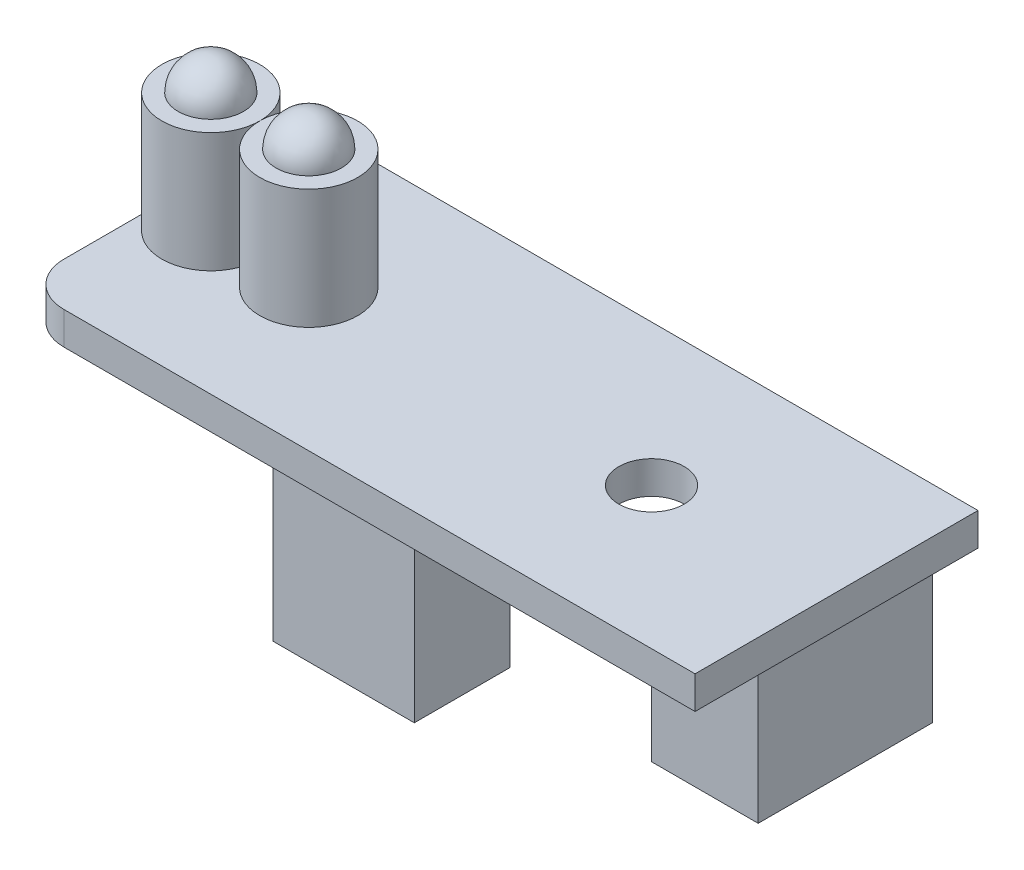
ISO-10303-21;
HEADER;
FILE_DESCRIPTION(('STEP AP214'),'2;1');
FILE_NAME('part.step','',(''),(''),'','','');
FILE_SCHEMA(('AUTOMOTIVE_DESIGN { 1 0 10303 214 1 1 1 1 }'));
ENDSEC;
DATA;
#1=APPLICATION_CONTEXT('core data for automotive mechanical design processes');
#2=APPLICATION_PROTOCOL_DEFINITION('international standard','automotive_design',2000,#1);
#3=PRODUCT_CONTEXT('',#1,'mechanical');
#4=PRODUCT('Part','Part','',(#3));
#5=PRODUCT_RELATED_PRODUCT_CATEGORY('part','',(#4));
#6=PRODUCT_DEFINITION_FORMATION('','',#4);
#7=PRODUCT_DEFINITION_CONTEXT('part definition',#1,'design');
#8=PRODUCT_DEFINITION('design','',#6,#7);
#9=PRODUCT_DEFINITION_SHAPE('','',#8);
#10=(LENGTH_UNIT() NAMED_UNIT(*) SI_UNIT(.MILLI.,.METRE.));
#11=(NAMED_UNIT(*) PLANE_ANGLE_UNIT() SI_UNIT($,.RADIAN.));
#12=(NAMED_UNIT(*) SI_UNIT($,.STERADIAN.) SOLID_ANGLE_UNIT());
#13=UNCERTAINTY_MEASURE_WITH_UNIT(LENGTH_MEASURE(1.E-05),#10,'distance_accuracy_value','');
#14=(GEOMETRIC_REPRESENTATION_CONTEXT(3) GLOBAL_UNCERTAINTY_ASSIGNED_CONTEXT((#13)) GLOBAL_UNIT_ASSIGNED_CONTEXT((#10,
#11,#12)) REPRESENTATION_CONTEXT('',''));
#15=CARTESIAN_POINT('',(0.,0.,0.));
#16=DIRECTION('',(0.,0.,1.));
#17=DIRECTION('',(1.,0.,0.));
#18=AXIS2_PLACEMENT_3D('',#15,#16,#17);
#19=CARTESIAN_POINT('',(-8.75,7.,0.));
#20=DIRECTION('',(0.,-1.,0.));
#21=DIRECTION('',(0.,0.,-1.));
#22=AXIS2_PLACEMENT_3D('',#19,#20,#21);
#23=CYLINDRICAL_SURFACE('',#22,2.25);
#24=CARTESIAN_POINT('',(-8.75,7.,0.));
#25=DIRECTION('',(0.,1.,0.));
#26=DIRECTION('',(0.,0.,1.));
#27=AXIS2_PLACEMENT_3D('',#24,#25,#26);
#28=CIRCLE('',#27,2.25);
#29=CARTESIAN_POINT('',(-8.75,7.,2.25));
#30=VERTEX_POINT('',#29);
#31=EDGE_CURVE('E57',#30,#30,#28,.T.);
#32=ORIENTED_EDGE('',*,*,#31,.F.);
#33=EDGE_LOOP('',(#32));
#34=FACE_BOUND('',#33,.T.);
#35=CARTESIAN_POINT('',(-8.75,1.5,0.));
#36=DIRECTION('',(0.,1.,0.));
#37=DIRECTION('',(0.,0.,1.));
#38=AXIS2_PLACEMENT_3D('',#35,#36,#37);
#39=CIRCLE('',#38,2.25);
#40=CARTESIAN_POINT('',(-8.75,1.5,2.25));
#41=VERTEX_POINT('',#40);
#42=EDGE_CURVE('E61',#41,#41,#39,.T.);
#43=ORIENTED_EDGE('',*,*,#42,.T.);
#44=EDGE_LOOP('',(#43));
#45=FACE_BOUND('',#44,.T.);
#46=ADVANCED_FACE('F51',(#34,#45),#23,.T.);
#47=CARTESIAN_POINT('',(0.,7.,0.));
#48=DIRECTION('',(0.,1.,0.));
#49=DIRECTION('',(0.,0.,1.));
#50=AXIS2_PLACEMENT_3D('',#47,#48,#49);
#51=PLANE('',#50);
#52=CARTESIAN_POINT('',(-8.75,7.,0.));
#53=DIRECTION('',(0.,1.,0.));
#54=DIRECTION('',(0.,0.,1.));
#55=AXIS2_PLACEMENT_3D('',#52,#53,#54);
#56=CIRCLE('',#55,1.5);
#57=CARTESIAN_POINT('',(-8.75,7.,1.5));
#58=VERTEX_POINT('',#57);
#59=EDGE_CURVE('E12',#58,#58,#56,.T.);
#60=ORIENTED_EDGE('',*,*,#59,.F.);
#61=EDGE_LOOP('',(#60));
#62=FACE_BOUND('',#61,.T.);
#63=ORIENTED_EDGE('',*,*,#31,.T.);
#64=EDGE_LOOP('',(#63));
#65=FACE_BOUND('',#64,.T.);
#66=ADVANCED_FACE('F72',(#62,#65),#51,.T.);
#67=CARTESIAN_POINT('',(0.,1.5,0.));
#68=DIRECTION('',(0.,1.,0.));
#69=DIRECTION('',(0.,0.,1.));
#70=AXIS2_PLACEMENT_3D('',#67,#68,#69);
#71=PLANE('',#70);
#72=ORIENTED_EDGE('',*,*,#42,.F.);
#73=EDGE_LOOP('',(#72));
#74=FACE_BOUND('',#73,.T.);
#75=ADVANCED_FACE('F69',(#74),#71,.F.);
#76=CARTESIAN_POINT('',(-8.75,7.,0.));
#77=DIRECTION('',(0.,0.,-1.));
#78=DIRECTION('',(1.,0.,0.));
#79=AXIS2_PLACEMENT_3D('',#76,#77,#78);
#80=SPHERICAL_SURFACE('',#79,1.5);
#81=CARTESIAN_POINT('',(-8.75,7.,0.));
#82=DIRECTION('',(0.,1.,0.));
#83=DIRECTION('',(0.,0.,1.));
#84=AXIS2_PLACEMENT_3D('',#81,#82,#83);
#85=SPHERICAL_SURFACE('',#84,1.5);
#86=ORIENTED_EDGE('',*,*,#59,.T.);
#87=EDGE_LOOP('',(#86));
#88=FACE_BOUND('',#87,.T.);
#89=ADVANCED_FACE('F71',(#88),#85,.T.);
#90=CLOSED_SHELL('',(#46,#66,#75,#89));
#91=MANIFOLD_SOLID_BREP('B2',#90);
#92=CARTESIAN_POINT('',(-13.25,7.,0.));
#93=DIRECTION('',(0.,-1.,0.));
#94=DIRECTION('',(0.,0.,-1.));
#95=AXIS2_PLACEMENT_3D('',#92,#93,#94);
#96=CYLINDRICAL_SURFACE('',#95,2.25);
#97=CARTESIAN_POINT('',(-13.25,7.,0.));
#98=DIRECTION('',(0.,1.,0.));
#99=DIRECTION('',(0.,0.,1.));
#100=AXIS2_PLACEMENT_3D('',#97,#98,#99);
#101=CIRCLE('',#100,2.25);
#102=CARTESIAN_POINT('',(-13.25,7.,2.25));
#103=VERTEX_POINT('',#102);
#104=EDGE_CURVE('E131',#103,#103,#101,.T.);
#105=ORIENTED_EDGE('',*,*,#104,.F.);
#106=EDGE_LOOP('',(#105));
#107=FACE_BOUND('',#106,.T.);
#108=CARTESIAN_POINT('',(-13.25,1.5,0.));
#109=DIRECTION('',(0.,1.,0.));
#110=DIRECTION('',(0.,0.,1.));
#111=AXIS2_PLACEMENT_3D('',#108,#109,#110);
#112=CIRCLE('',#111,2.25);
#113=CARTESIAN_POINT('',(-13.25,1.5,2.25));
#114=VERTEX_POINT('',#113);
#115=EDGE_CURVE('E135',#114,#114,#112,.T.);
#116=ORIENTED_EDGE('',*,*,#115,.T.);
#117=EDGE_LOOP('',(#116));
#118=FACE_BOUND('',#117,.T.);
#119=ADVANCED_FACE('F125',(#107,#118),#96,.T.);
#120=CARTESIAN_POINT('',(0.,7.,0.));
#121=DIRECTION('',(0.,1.,0.));
#122=DIRECTION('',(0.,0.,1.));
#123=AXIS2_PLACEMENT_3D('',#120,#121,#122);
#124=PLANE('',#123);
#125=CARTESIAN_POINT('',(-13.25,7.,0.));
#126=DIRECTION('',(0.,1.,0.));
#127=DIRECTION('',(0.,0.,1.));
#128=AXIS2_PLACEMENT_3D('',#125,#126,#127);
#129=CIRCLE('',#128,1.5);
#130=CARTESIAN_POINT('',(-13.25,7.,1.5));
#131=VERTEX_POINT('',#130);
#132=EDGE_CURVE('E50',#131,#131,#129,.T.);
#133=ORIENTED_EDGE('',*,*,#132,.F.);
#134=EDGE_LOOP('',(#133));
#135=FACE_BOUND('',#134,.T.);
#136=ORIENTED_EDGE('',*,*,#104,.T.);
#137=EDGE_LOOP('',(#136));
#138=FACE_BOUND('',#137,.T.);
#139=ADVANCED_FACE('F146',(#135,#138),#124,.T.);
#140=CARTESIAN_POINT('',(0.,1.5,0.));
#141=DIRECTION('',(0.,1.,0.));
#142=DIRECTION('',(0.,0.,1.));
#143=AXIS2_PLACEMENT_3D('',#140,#141,#142);
#144=PLANE('',#143);
#145=ORIENTED_EDGE('',*,*,#115,.F.);
#146=EDGE_LOOP('',(#145));
#147=FACE_BOUND('',#146,.T.);
#148=ADVANCED_FACE('F143',(#147),#144,.F.);
#149=CARTESIAN_POINT('',(-13.25,7.,0.));
#150=DIRECTION('',(0.,0.,-1.));
#151=DIRECTION('',(1.,0.,0.));
#152=AXIS2_PLACEMENT_3D('',#149,#150,#151);
#153=SPHERICAL_SURFACE('',#152,1.5);
#154=CARTESIAN_POINT('',(-13.25,7.,0.));
#155=DIRECTION('',(0.,1.,0.));
#156=DIRECTION('',(0.,0.,1.));
#157=AXIS2_PLACEMENT_3D('',#154,#155,#156);
#158=SPHERICAL_SURFACE('',#157,1.5);
#159=ORIENTED_EDGE('',*,*,#132,.T.);
#160=EDGE_LOOP('',(#159));
#161=FACE_BOUND('',#160,.T.);
#162=ADVANCED_FACE('F145',(#161),#158,.T.);
#163=CLOSED_SHELL('',(#119,#139,#148,#162));
#164=MANIFOLD_SOLID_BREP('B7',#163);
#165=CARTESIAN_POINT('',(2.5,-7.,2.));
#166=DIRECTION('',(-1.,0.,0.));
#167=DIRECTION('',(0.,0.,1.));
#168=AXIS2_PLACEMENT_3D('',#165,#166,#167);
#169=PLANE('',#168);
#170=DIRECTION('',(0.,1.,0.));
#171=VECTOR('',#170,1.);
#172=CARTESIAN_POINT('',(2.5,-7.,6.4));
#173=LINE('',#172,#171);
#174=CARTESIAN_POINT('',(2.5,-7.,6.4));
#175=VERTEX_POINT('',#174);
#176=CARTESIAN_POINT('',(2.5,0.,6.4));
#177=VERTEX_POINT('',#176);
#178=EDGE_CURVE('E513',#175,#177,#173,.T.);
#179=ORIENTED_EDGE('',*,*,#178,.F.);
#180=DIRECTION('',(0.,0.,1.));
#181=VECTOR('',#180,1.);
#182=CARTESIAN_POINT('',(2.5,-7.,2.));
#183=LINE('',#182,#181);
#184=CARTESIAN_POINT('',(2.5,-7.,2.));
#185=VERTEX_POINT('',#184);
#186=EDGE_CURVE('E405',#185,#175,#183,.T.);
#187=ORIENTED_EDGE('',*,*,#186,.F.);
#188=DIRECTION('',(0.,1.,0.));
#189=VECTOR('',#188,1.);
#190=CARTESIAN_POINT('',(2.5,-7.,2.));
#191=LINE('',#190,#189);
#192=CARTESIAN_POINT('',(2.5,0.,2.));
#193=VERTEX_POINT('',#192);
#194=EDGE_CURVE('E413',#185,#193,#191,.T.);
#195=ORIENTED_EDGE('',*,*,#194,.T.);
#196=DIRECTION('',(0.,0.,1.));
#197=VECTOR('',#196,1.);
#198=CARTESIAN_POINT('',(2.5,0.,2.));
#199=LINE('',#198,#197);
#200=EDGE_CURVE('E404',#193,#177,#199,.T.);
#201=ORIENTED_EDGE('',*,*,#200,.T.);
#202=EDGE_LOOP('',(#179,#187,#195,#201));
#203=FACE_BOUND('',#202,.T.);
#204=ADVANCED_FACE('F186',(#203),#169,.F.);
#205=CARTESIAN_POINT('',(-4.,-7.,2.));
#206=DIRECTION('',(1.,0.,0.));
#207=DIRECTION('',(0.,0.,-1.));
#208=AXIS2_PLACEMENT_3D('',#205,#206,#207);
#209=PLANE('',#208);
#210=DIRECTION('',(0.,-1.,0.));
#211=VECTOR('',#210,1.);
#212=CARTESIAN_POINT('',(-4.,0.,6.4));
#213=LINE('',#212,#211);
#214=CARTESIAN_POINT('',(-4.,0.,6.4));
#215=VERTEX_POINT('',#214);
#216=CARTESIAN_POINT('',(-4.,-7.,6.4));
#217=VERTEX_POINT('',#216);
#218=EDGE_CURVE('E212',#215,#217,#213,.T.);
#219=ORIENTED_EDGE('',*,*,#218,.F.);
#220=DIRECTION('',(0.,0.,-1.));
#221=VECTOR('',#220,1.);
#222=CARTESIAN_POINT('',(-4.,0.,2.));
#223=LINE('',#222,#221);
#224=CARTESIAN_POINT('',(-4.,0.,2.));
#225=VERTEX_POINT('',#224);
#226=EDGE_CURVE('E190',#215,#225,#223,.T.);
#227=ORIENTED_EDGE('',*,*,#226,.T.);
#228=DIRECTION('',(0.,1.,0.));
#229=VECTOR('',#228,1.);
#230=CARTESIAN_POINT('',(-4.,-7.,2.));
#231=LINE('',#230,#229);
#232=CARTESIAN_POINT('',(-4.,-7.,2.));
#233=VERTEX_POINT('',#232);
#234=EDGE_CURVE('E493',#233,#225,#231,.T.);
#235=ORIENTED_EDGE('',*,*,#234,.F.);
#236=DIRECTION('',(0.,0.,-1.));
#237=VECTOR('',#236,1.);
#238=CARTESIAN_POINT('',(-4.,-7.,2.));
#239=LINE('',#238,#237);
#240=EDGE_CURVE('E408',#217,#233,#239,.T.);
#241=ORIENTED_EDGE('',*,*,#240,.F.);
#242=EDGE_LOOP('',(#219,#227,#235,#241));
#243=FACE_BOUND('',#242,.T.);
#244=ADVANCED_FACE('F509',(#243),#209,.F.);
#245=CARTESIAN_POINT('',(0.,-7.,0.));
#246=DIRECTION('',(0.,1.,0.));
#247=DIRECTION('',(0.,0.,1.));
#248=AXIS2_PLACEMENT_3D('',#245,#246,#247);
#249=PLANE('',#248);
#250=DIRECTION('',(1.,0.,0.));
#251=VECTOR('',#250,1.);
#252=CARTESIAN_POINT('',(-4.,-7.,6.4));
#253=LINE('',#252,#251);
#254=EDGE_CURVE('E516',#217,#175,#253,.T.);
#255=ORIENTED_EDGE('',*,*,#254,.F.);
#256=ORIENTED_EDGE('',*,*,#240,.T.);
#257=DIRECTION('',(1.,0.,0.));
#258=VECTOR('',#257,1.);
#259=CARTESIAN_POINT('',(-4.,-7.,2.));
#260=LINE('',#259,#258);
#261=EDGE_CURVE('E411',#233,#185,#260,.T.);
#262=ORIENTED_EDGE('',*,*,#261,.T.);
#263=ORIENTED_EDGE('',*,*,#186,.T.);
#264=EDGE_LOOP('',(#255,#256,#262,#263));
#265=FACE_BOUND('',#264,.T.);
#266=ADVANCED_FACE('F599',(#265),#249,.F.);
#267=CARTESIAN_POINT('',(0.,0.,0.));
#268=DIRECTION('',(0.,1.,0.));
#269=DIRECTION('',(0.,0.,1.));
#270=AXIS2_PLACEMENT_3D('',#267,#268,#269);
#271=PLANE('',#270);
#272=DIRECTION('',(-1.,0.,0.));
#273=VECTOR('',#272,1.);
#274=CARTESIAN_POINT('',(10.5,0.,3.5));
#275=LINE('',#274,#273);
#276=CARTESIAN_POINT('',(15.4,0.,3.5));
#277=VERTEX_POINT('',#276);
#278=CARTESIAN_POINT('',(10.5,0.,3.5));
#279=VERTEX_POINT('',#278);
#280=EDGE_CURVE('E344',#277,#279,#275,.T.);
#281=ORIENTED_EDGE('',*,*,#280,.F.);
#282=DIRECTION('',(0.,0.,1.));
#283=VECTOR('',#282,1.);
#284=CARTESIAN_POINT('',(15.4,0.,3.5));
#285=LINE('',#284,#283);
#286=CARTESIAN_POINT('',(15.4,0.,-4.5));
#287=VERTEX_POINT('',#286);
#288=EDGE_CURVE('E337',#287,#277,#285,.T.);
#289=ORIENTED_EDGE('',*,*,#288,.F.);
#290=DIRECTION('',(1.,0.,0.));
#291=VECTOR('',#290,1.);
#292=CARTESIAN_POINT('',(10.5,0.,-4.5));
#293=LINE('',#292,#291);
#294=CARTESIAN_POINT('',(10.5,0.,-4.5));
#295=VERTEX_POINT('',#294);
#296=EDGE_CURVE('E343',#295,#287,#293,.T.);
#297=ORIENTED_EDGE('',*,*,#296,.F.);
#298=DIRECTION('',(0.,0.,-1.));
#299=VECTOR('',#298,1.);
#300=CARTESIAN_POINT('',(10.5,0.,3.5));
#301=LINE('',#300,#299);
#302=EDGE_CURVE('E359',#279,#295,#301,.T.);
#303=ORIENTED_EDGE('',*,*,#302,.F.);
#304=EDGE_LOOP('',(#281,#289,#297,#303));
#305=FACE_BOUND('',#304,.T.);
#306=DIRECTION('',(0.,0.,-1.));
#307=VECTOR('',#306,1.);
#308=CARTESIAN_POINT('',(15.5,0.,-6.5));
#309=LINE('',#308,#307);
#310=CARTESIAN_POINT('',(15.5,0.,6.5));
#311=VERTEX_POINT('',#310);
#312=CARTESIAN_POINT('',(15.5,0.,-6.5));
#313=VERTEX_POINT('',#312);
#314=EDGE_CURVE('E476',#311,#313,#309,.T.);
#315=ORIENTED_EDGE('',*,*,#314,.F.);
#316=DIRECTION('',(1.,0.,0.));
#317=VECTOR('',#316,1.);
#318=CARTESIAN_POINT('',(-15.5,0.,6.5));
#319=LINE('',#318,#317);
#320=CARTESIAN_POINT('',(-13.5,0.,6.5));
#321=VERTEX_POINT('',#320);
#322=EDGE_CURVE('E420',#321,#311,#319,.T.);
#323=ORIENTED_EDGE('',*,*,#322,.F.);
#324=CARTESIAN_POINT('',(-13.5,0.,4.5));
#325=DIRECTION('',(0.,1.,0.));
#326=DIRECTION('',(0.,0.,1.));
#327=AXIS2_PLACEMENT_3D('',#324,#325,#326);
#328=CIRCLE('',#327,2.);
#329=CARTESIAN_POINT('',(-15.5,0.,4.5));
#330=VERTEX_POINT('',#329);
#331=EDGE_CURVE('E441',#321,#330,#328,.F.);
#332=ORIENTED_EDGE('',*,*,#331,.T.);
#333=DIRECTION('',(0.,0.,1.));
#334=VECTOR('',#333,1.);
#335=CARTESIAN_POINT('',(-15.5,0.,-6.5));
#336=LINE('',#335,#334);
#337=CARTESIAN_POINT('',(-15.5,0.,-4.5));
#338=VERTEX_POINT('',#337);
#339=EDGE_CURVE('E423',#338,#330,#336,.T.);
#340=ORIENTED_EDGE('',*,*,#339,.F.);
#341=CARTESIAN_POINT('',(-13.5,0.,-4.5));
#342=DIRECTION('',(0.,1.,0.));
#343=DIRECTION('',(0.,0.,1.));
#344=AXIS2_PLACEMENT_3D('',#341,#342,#343);
#345=CIRCLE('',#344,2.);
#346=CARTESIAN_POINT('',(-13.5,0.,-6.5));
#347=VERTEX_POINT('',#346);
#348=EDGE_CURVE('E439',#338,#347,#345,.F.);
#349=ORIENTED_EDGE('',*,*,#348,.T.);
#350=DIRECTION('',(-1.,0.,0.));
#351=VECTOR('',#350,1.);
#352=CARTESIAN_POINT('',(-15.5,0.,-6.5));
#353=LINE('',#352,#351);
#354=EDGE_CURVE('E474',#313,#347,#353,.T.);
#355=ORIENTED_EDGE('',*,*,#354,.F.);
#356=EDGE_LOOP('',(#315,#323,#332,#340,#349,#355));
#357=FACE_BOUND('',#356,.T.);
#358=DIRECTION('',(0.,0.,1.));
#359=VECTOR('',#358,1.);
#360=CARTESIAN_POINT('',(1.,0.,-0.105895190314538));
#361=LINE('',#360,#359);
#362=CARTESIAN_POINT('',(1.00000000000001,0.,-5.10589519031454));
#363=VERTEX_POINT('',#362);
#364=CARTESIAN_POINT('',(1.,0.,-0.105895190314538));
#365=VERTEX_POINT('',#364);
#366=EDGE_CURVE('E371',#363,#365,#361,.T.);
#367=ORIENTED_EDGE('',*,*,#366,.F.);
#368=DIRECTION('',(1.,0.,0.));
#369=VECTOR('',#368,1.);
#370=CARTESIAN_POINT('',(-3.,0.,-5.10589519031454));
#371=LINE('',#370,#369);
#372=CARTESIAN_POINT('',(-3.,0.,-5.10589519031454));
#373=VERTEX_POINT('',#372);
#374=EDGE_CURVE('E376',#373,#363,#371,.T.);
#375=ORIENTED_EDGE('',*,*,#374,.F.);
#376=DIRECTION('',(0.,0.,-1.));
#377=VECTOR('',#376,1.);
#378=CARTESIAN_POINT('',(-3.,0.,-0.105895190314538));
#379=LINE('',#378,#377);
#380=CARTESIAN_POINT('',(-3.,0.,-0.105895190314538));
#381=VERTEX_POINT('',#380);
#382=EDGE_CURVE('E388',#381,#373,#379,.T.);
#383=ORIENTED_EDGE('',*,*,#382,.F.);
#384=DIRECTION('',(-1.,0.,0.));
#385=VECTOR('',#384,1.);
#386=CARTESIAN_POINT('',(-3.,0.,-0.105895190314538));
#387=LINE('',#386,#385);
#388=EDGE_CURVE('E385',#365,#381,#387,.T.);
#389=ORIENTED_EDGE('',*,*,#388,.F.);
#390=EDGE_LOOP('',(#367,#375,#383,#389));
#391=FACE_BOUND('',#390,.T.);
#392=CARTESIAN_POINT('',(7.,0.,0.));
#393=DIRECTION('',(0.,-1.,0.));
#394=DIRECTION('',(0.,0.,-1.));
#395=AXIS2_PLACEMENT_3D('',#392,#393,#394);
#396=CIRCLE('',#395,1.5);
#397=CARTESIAN_POINT('',(7.,0.,-1.5));
#398=VERTEX_POINT('',#397);
#399=EDGE_CURVE('E490',#398,#398,#396,.T.);
#400=ORIENTED_EDGE('',*,*,#399,.F.);
#401=EDGE_LOOP('',(#400));
#402=FACE_BOUND('',#401,.T.);
#403=DIRECTION('',(-1.,0.,0.));
#404=VECTOR('',#403,1.);
#405=CARTESIAN_POINT('',(2.5,0.,6.4));
#406=LINE('',#405,#404);
#407=EDGE_CURVE('E511',#177,#215,#406,.T.);
#408=ORIENTED_EDGE('',*,*,#407,.F.);
#409=ORIENTED_EDGE('',*,*,#200,.F.);
#410=DIRECTION('',(1.,0.,0.));
#411=VECTOR('',#410,1.);
#412=CARTESIAN_POINT('',(-4.,0.,2.));
#413=LINE('',#412,#411);
#414=EDGE_CURVE('E409',#225,#193,#413,.T.);
#415=ORIENTED_EDGE('',*,*,#414,.F.);
#416=ORIENTED_EDGE('',*,*,#226,.F.);
#417=EDGE_LOOP('',(#408,#409,#415,#416));
#418=FACE_BOUND('',#417,.T.);
#419=ADVANCED_FACE('F339',(#305,#357,#391,#402,#418),#271,.F.);
#420=CARTESIAN_POINT('',(15.5,1.5,-6.5));
#421=DIRECTION('',(-1.,0.,0.));
#422=DIRECTION('',(0.,0.,1.));
#423=AXIS2_PLACEMENT_3D('',#420,#421,#422);
#424=PLANE('',#423);
#425=ORIENTED_EDGE('',*,*,#314,.T.);
#426=DIRECTION('',(0.,-1.,0.));
#427=VECTOR('',#426,1.);
#428=CARTESIAN_POINT('',(15.5,1.5,-6.5));
#429=LINE('',#428,#427);
#430=CARTESIAN_POINT('',(15.5,1.5,-6.5));
#431=VERTEX_POINT('',#430);
#432=EDGE_CURVE('E432',#431,#313,#429,.T.);
#433=ORIENTED_EDGE('',*,*,#432,.F.);
#434=DIRECTION('',(0.,0.,-1.));
#435=VECTOR('',#434,1.);
#436=CARTESIAN_POINT('',(15.5,1.5,-6.5));
#437=LINE('',#436,#435);
#438=CARTESIAN_POINT('',(15.5,1.5,6.5));
#439=VERTEX_POINT('',#438);
#440=EDGE_CURVE('E422',#439,#431,#437,.T.);
#441=ORIENTED_EDGE('',*,*,#440,.F.);
#442=DIRECTION('',(0.,-1.,0.));
#443=VECTOR('',#442,1.);
#444=CARTESIAN_POINT('',(15.5,1.5,6.5));
#445=LINE('',#444,#443);
#446=EDGE_CURVE('E429',#439,#311,#445,.T.);
#447=ORIENTED_EDGE('',*,*,#446,.T.);
#448=EDGE_LOOP('',(#425,#433,#441,#447));
#449=FACE_BOUND('',#448,.T.);
#450=ADVANCED_FACE('F612',(#449),#424,.F.);
#451=CARTESIAN_POINT('',(-15.5,1.5,-6.5));
#452=DIRECTION('',(0.,0.,1.));
#453=DIRECTION('',(1.,0.,0.));
#454=AXIS2_PLACEMENT_3D('',#451,#452,#453);
#455=PLANE('',#454);
#456=ORIENTED_EDGE('',*,*,#354,.T.);
#457=DIRECTION('',(0.,-1.,0.));
#458=VECTOR('',#457,1.);
#459=CARTESIAN_POINT('',(-13.5,1.5,-6.5));
#460=LINE('',#459,#458);
#461=CARTESIAN_POINT('',(-13.5,1.5,-6.5));
#462=VERTEX_POINT('',#461);
#463=EDGE_CURVE('E123',#347,#462,#460,.F.);
#464=ORIENTED_EDGE('',*,*,#463,.T.);
#465=DIRECTION('',(-1.,0.,0.));
#466=VECTOR('',#465,1.);
#467=CARTESIAN_POINT('',(-15.5,1.5,-6.5));
#468=LINE('',#467,#466);
#469=EDGE_CURVE('E484',#431,#462,#468,.T.);
#470=ORIENTED_EDGE('',*,*,#469,.F.);
#471=ORIENTED_EDGE('',*,*,#432,.T.);
#472=EDGE_LOOP('',(#456,#464,#470,#471));
#473=FACE_BOUND('',#472,.T.);
#474=ADVANCED_FACE('F617',(#473),#455,.F.);
#475=CARTESIAN_POINT('',(-15.5,1.5,-6.5));
#476=DIRECTION('',(1.,0.,0.));
#477=DIRECTION('',(0.,0.,-1.));
#478=AXIS2_PLACEMENT_3D('',#475,#476,#477);
#479=PLANE('',#478);
#480=ORIENTED_EDGE('',*,*,#339,.T.);
#481=DIRECTION('',(0.,-1.,0.));
#482=VECTOR('',#481,1.);
#483=CARTESIAN_POINT('',(-15.5,1.5,4.5));
#484=LINE('',#483,#482);
#485=CARTESIAN_POINT('',(-15.5,1.5,4.5));
#486=VERTEX_POINT('',#485);
#487=EDGE_CURVE('E446',#330,#486,#484,.F.);
#488=ORIENTED_EDGE('',*,*,#487,.T.);
#489=DIRECTION('',(0.,0.,1.));
#490=VECTOR('',#489,1.);
#491=CARTESIAN_POINT('',(-15.5,1.5,-6.5));
#492=LINE('',#491,#490);
#493=CARTESIAN_POINT('',(-15.5,1.5,-4.5));
#494=VERTEX_POINT('',#493);
#495=EDGE_CURVE('E457',#494,#486,#492,.T.);
#496=ORIENTED_EDGE('',*,*,#495,.F.);
#497=DIRECTION('',(0.,-1.,0.));
#498=VECTOR('',#497,1.);
#499=CARTESIAN_POINT('',(-15.5,1.5,-4.5));
#500=LINE('',#499,#498);
#501=EDGE_CURVE('E443',#494,#338,#500,.T.);
#502=ORIENTED_EDGE('',*,*,#501,.T.);
#503=EDGE_LOOP('',(#480,#488,#496,#502));
#504=FACE_BOUND('',#503,.T.);
#505=ADVANCED_FACE('F472',(#504),#479,.F.);
#506=CARTESIAN_POINT('',(-15.5,1.5,6.5));
#507=DIRECTION('',(0.,0.,-1.));
#508=DIRECTION('',(-1.,0.,0.));
#509=AXIS2_PLACEMENT_3D('',#506,#507,#508);
#510=PLANE('',#509);
#511=ORIENTED_EDGE('',*,*,#322,.T.);
#512=ORIENTED_EDGE('',*,*,#446,.F.);
#513=DIRECTION('',(1.,0.,0.));
#514=VECTOR('',#513,1.);
#515=CARTESIAN_POINT('',(-15.5,1.5,6.5));
#516=LINE('',#515,#514);
#517=CARTESIAN_POINT('',(-13.5,1.5,6.5));
#518=VERTEX_POINT('',#517);
#519=EDGE_CURVE('E433',#518,#439,#516,.T.);
#520=ORIENTED_EDGE('',*,*,#519,.F.);
#521=DIRECTION('',(0.,-1.,0.));
#522=VECTOR('',#521,1.);
#523=CARTESIAN_POINT('',(-13.5,1.5,6.5));
#524=LINE('',#523,#522);
#525=EDGE_CURVE('E436',#518,#321,#524,.T.);
#526=ORIENTED_EDGE('',*,*,#525,.T.);
#527=EDGE_LOOP('',(#511,#512,#520,#526));
#528=FACE_BOUND('',#527,.T.);
#529=ADVANCED_FACE('F462',(#528),#510,.F.);
#530=CARTESIAN_POINT('',(0.,1.5,0.));
#531=DIRECTION('',(0.,1.,0.));
#532=DIRECTION('',(0.,0.,1.));
#533=AXIS2_PLACEMENT_3D('',#530,#531,#532);
#534=PLANE('',#533);
#535=CARTESIAN_POINT('',(7.,1.5,0.));
#536=DIRECTION('',(0.,1.,0.));
#537=DIRECTION('',(0.,0.,1.));
#538=AXIS2_PLACEMENT_3D('',#535,#536,#537);
#539=CIRCLE('',#538,1.5);
#540=CARTESIAN_POINT('',(7.,1.5,1.5));
#541=VERTEX_POINT('',#540);
#542=EDGE_CURVE('E480',#541,#541,#539,.T.);
#543=ORIENTED_EDGE('',*,*,#542,.F.);
#544=EDGE_LOOP('',(#543));
#545=FACE_BOUND('',#544,.T.);
#546=ORIENTED_EDGE('',*,*,#495,.T.);
#547=CARTESIAN_POINT('',(-13.5,1.5,4.5));
#548=DIRECTION('',(0.,1.,0.));
#549=DIRECTION('',(0.,0.,1.));
#550=AXIS2_PLACEMENT_3D('',#547,#548,#549);
#551=CIRCLE('',#550,2.);
#552=EDGE_CURVE('E196',#486,#518,#551,.T.);
#553=ORIENTED_EDGE('',*,*,#552,.T.);
#554=ORIENTED_EDGE('',*,*,#519,.T.);
#555=ORIENTED_EDGE('',*,*,#440,.T.);
#556=ORIENTED_EDGE('',*,*,#469,.T.);
#557=CARTESIAN_POINT('',(-13.5,1.5,-4.5));
#558=DIRECTION('',(0.,1.,0.));
#559=DIRECTION('',(0.,0.,1.));
#560=AXIS2_PLACEMENT_3D('',#557,#558,#559);
#561=CIRCLE('',#560,2.);
#562=EDGE_CURVE('E448',#462,#494,#561,.T.);
#563=ORIENTED_EDGE('',*,*,#562,.T.);
#564=EDGE_LOOP('',(#546,#553,#554,#555,#556,#563));
#565=FACE_BOUND('',#564,.T.);
#566=ADVANCED_FACE('F453',(#545,#565),#534,.T.);
#567=CARTESIAN_POINT('',(-13.5,1.5,4.5));
#568=DIRECTION('',(0.,-1.,0.));
#569=DIRECTION('',(0.,0.,-1.));
#570=AXIS2_PLACEMENT_3D('',#567,#568,#569);
#571=CYLINDRICAL_SURFACE('',#570,2.);
#572=ORIENTED_EDGE('',*,*,#552,.F.);
#573=ORIENTED_EDGE('',*,*,#487,.F.);
#574=ORIENTED_EDGE('',*,*,#331,.F.);
#575=ORIENTED_EDGE('',*,*,#525,.F.);
#576=EDGE_LOOP('',(#572,#573,#574,#575));
#577=FACE_BOUND('',#576,.T.);
#578=ADVANCED_FACE('F466',(#577),#571,.T.);
#579=CARTESIAN_POINT('',(-13.5,1.5,-4.5));
#580=DIRECTION('',(0.,-1.,0.));
#581=DIRECTION('',(0.,0.,-1.));
#582=AXIS2_PLACEMENT_3D('',#579,#580,#581);
#583=CYLINDRICAL_SURFACE('',#582,2.);
#584=ORIENTED_EDGE('',*,*,#562,.F.);
#585=ORIENTED_EDGE('',*,*,#463,.F.);
#586=ORIENTED_EDGE('',*,*,#348,.F.);
#587=ORIENTED_EDGE('',*,*,#501,.F.);
#588=EDGE_LOOP('',(#584,#585,#586,#587));
#589=FACE_BOUND('',#588,.T.);
#590=ADVANCED_FACE('F188',(#589),#583,.T.);
#591=CARTESIAN_POINT('',(7.,5.5,0.));
#592=DIRECTION('',(0.,-1.,0.));
#593=DIRECTION('',(0.,0.,-1.));
#594=AXIS2_PLACEMENT_3D('',#591,#592,#593);
#595=CYLINDRICAL_SURFACE('',#594,1.5);
#596=ORIENTED_EDGE('',*,*,#542,.T.);
#597=EDGE_LOOP('',(#596));
#598=FACE_BOUND('',#597,.T.);
#599=ORIENTED_EDGE('',*,*,#399,.T.);
#600=EDGE_LOOP('',(#599));
#601=FACE_BOUND('',#600,.T.);
#602=ADVANCED_FACE('F603',(#598,#601),#595,.F.);
#603=CARTESIAN_POINT('',(-4.,-7.,2.));
#604=DIRECTION('',(0.,0.,1.));
#605=DIRECTION('',(1.,0.,0.));
#606=AXIS2_PLACEMENT_3D('',#603,#604,#605);
#607=PLANE('',#606);
#608=ORIENTED_EDGE('',*,*,#414,.T.);
#609=ORIENTED_EDGE('',*,*,#194,.F.);
#610=ORIENTED_EDGE('',*,*,#261,.F.);
#611=ORIENTED_EDGE('',*,*,#234,.T.);
#612=EDGE_LOOP('',(#608,#609,#610,#611));
#613=FACE_BOUND('',#612,.T.);
#614=ADVANCED_FACE('F503',(#613),#607,.F.);
#615=CARTESIAN_POINT('',(1.,-1.5,-0.105895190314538));
#616=DIRECTION('',(-1.,0.,0.));
#617=DIRECTION('',(0.,0.,1.));
#618=AXIS2_PLACEMENT_3D('',#615,#616,#617);
#619=PLANE('',#618);
#620=ORIENTED_EDGE('',*,*,#366,.T.);
#621=DIRECTION('',(0.,1.,0.));
#622=VECTOR('',#621,1.);
#623=CARTESIAN_POINT('',(1.,-1.5,-0.105895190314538));
#624=LINE('',#623,#622);
#625=CARTESIAN_POINT('',(1.,-1.5,-0.105895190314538));
#626=VERTEX_POINT('',#625);
#627=EDGE_CURVE('E401',#626,#365,#624,.T.);
#628=ORIENTED_EDGE('',*,*,#627,.F.);
#629=DIRECTION('',(0.,0.,1.));
#630=VECTOR('',#629,1.);
#631=CARTESIAN_POINT('',(1.,-1.5,-0.105895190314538));
#632=LINE('',#631,#630);
#633=CARTESIAN_POINT('',(1.00000000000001,-1.5,-5.10589519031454));
#634=VERTEX_POINT('',#633);
#635=EDGE_CURVE('E372',#634,#626,#632,.T.);
#636=ORIENTED_EDGE('',*,*,#635,.F.);
#637=DIRECTION('',(0.,1.,0.));
#638=VECTOR('',#637,1.);
#639=CARTESIAN_POINT('',(1.00000000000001,-1.5,-5.10589519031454));
#640=LINE('',#639,#638);
#641=EDGE_CURVE('E382',#634,#363,#640,.T.);
#642=ORIENTED_EDGE('',*,*,#641,.T.);
#643=EDGE_LOOP('',(#620,#628,#636,#642));
#644=FACE_BOUND('',#643,.T.);
#645=ADVANCED_FACE('F641',(#644),#619,.F.);
#646=CARTESIAN_POINT('',(-3.,-1.5,-0.105895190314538));
#647=DIRECTION('',(0.,0.,-1.));
#648=DIRECTION('',(-1.,0.,0.));
#649=AXIS2_PLACEMENT_3D('',#646,#647,#648);
#650=PLANE('',#649);
#651=ORIENTED_EDGE('',*,*,#388,.T.);
#652=DIRECTION('',(0.,1.,0.));
#653=VECTOR('',#652,1.);
#654=CARTESIAN_POINT('',(-3.,-1.5,-0.105895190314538));
#655=LINE('',#654,#653);
#656=CARTESIAN_POINT('',(-3.,-1.5,-0.105895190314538));
#657=VERTEX_POINT('',#656);
#658=EDGE_CURVE('E398',#657,#381,#655,.T.);
#659=ORIENTED_EDGE('',*,*,#658,.F.);
#660=DIRECTION('',(-1.,0.,0.));
#661=VECTOR('',#660,1.);
#662=CARTESIAN_POINT('',(-3.,-1.5,-0.105895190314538));
#663=LINE('',#662,#661);
#664=EDGE_CURVE('E375',#626,#657,#663,.T.);
#665=ORIENTED_EDGE('',*,*,#664,.F.);
#666=ORIENTED_EDGE('',*,*,#627,.T.);
#667=EDGE_LOOP('',(#651,#659,#665,#666));
#668=FACE_BOUND('',#667,.T.);
#669=ADVANCED_FACE('F648',(#668),#650,.F.);
#670=CARTESIAN_POINT('',(-3.,-1.5,-0.105895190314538));
#671=DIRECTION('',(1.,0.,0.));
#672=DIRECTION('',(0.,0.,-1.));
#673=AXIS2_PLACEMENT_3D('',#670,#671,#672);
#674=PLANE('',#673);
#675=ORIENTED_EDGE('',*,*,#382,.T.);
#676=DIRECTION('',(0.,1.,0.));
#677=VECTOR('',#676,1.);
#678=CARTESIAN_POINT('',(-3.,-1.5,-5.10589519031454));
#679=LINE('',#678,#677);
#680=CARTESIAN_POINT('',(-3.,-1.5,-5.10589519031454));
#681=VERTEX_POINT('',#680);
#682=EDGE_CURVE('E395',#681,#373,#679,.T.);
#683=ORIENTED_EDGE('',*,*,#682,.F.);
#684=DIRECTION('',(0.,0.,-1.));
#685=VECTOR('',#684,1.);
#686=CARTESIAN_POINT('',(-3.,-1.5,-0.105895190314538));
#687=LINE('',#686,#685);
#688=EDGE_CURVE('E378',#657,#681,#687,.T.);
#689=ORIENTED_EDGE('',*,*,#688,.F.);
#690=ORIENTED_EDGE('',*,*,#658,.T.);
#691=EDGE_LOOP('',(#675,#683,#689,#690));
#692=FACE_BOUND('',#691,.T.);
#693=ADVANCED_FACE('F656',(#692),#674,.F.);
#694=CARTESIAN_POINT('',(-3.,-1.5,-5.10589519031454));
#695=DIRECTION('',(0.,0.,1.));
#696=DIRECTION('',(1.,0.,0.));
#697=AXIS2_PLACEMENT_3D('',#694,#695,#696);
#698=PLANE('',#697);
#699=ORIENTED_EDGE('',*,*,#374,.T.);
#700=ORIENTED_EDGE('',*,*,#641,.F.);
#701=DIRECTION('',(1.,0.,0.));
#702=VECTOR('',#701,1.);
#703=CARTESIAN_POINT('',(-3.,-1.5,-5.10589519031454));
#704=LINE('',#703,#702);
#705=EDGE_CURVE('E380',#681,#634,#704,.T.);
#706=ORIENTED_EDGE('',*,*,#705,.F.);
#707=ORIENTED_EDGE('',*,*,#682,.T.);
#708=EDGE_LOOP('',(#699,#700,#706,#707));
#709=FACE_BOUND('',#708,.T.);
#710=ADVANCED_FACE('F664',(#709),#698,.F.);
#711=CARTESIAN_POINT('',(0.,-1.5,0.));
#712=DIRECTION('',(0.,-1.,0.));
#713=DIRECTION('',(0.,0.,-1.));
#714=AXIS2_PLACEMENT_3D('',#711,#712,#713);
#715=PLANE('',#714);
#716=ORIENTED_EDGE('',*,*,#635,.T.);
#717=ORIENTED_EDGE('',*,*,#664,.T.);
#718=ORIENTED_EDGE('',*,*,#688,.T.);
#719=ORIENTED_EDGE('',*,*,#705,.T.);
#720=EDGE_LOOP('',(#716,#717,#718,#719));
#721=FACE_BOUND('',#720,.T.);
#722=ADVANCED_FACE('F672',(#721),#715,.T.);
#723=CARTESIAN_POINT('',(10.5,-6.,3.5));
#724=DIRECTION('',(0.,0.,-1.));
#725=DIRECTION('',(-1.,0.,0.));
#726=AXIS2_PLACEMENT_3D('',#723,#724,#725);
#727=PLANE('',#726);
#728=DIRECTION('',(-1.,0.,0.));
#729=VECTOR('',#728,1.);
#730=CARTESIAN_POINT('',(10.5,-6.,3.5));
#731=LINE('',#730,#729);
#732=CARTESIAN_POINT('',(15.4,-6.,3.5));
#733=VERTEX_POINT('',#732);
#734=CARTESIAN_POINT('',(10.5,-6.,3.5));
#735=VERTEX_POINT('',#734);
#736=EDGE_CURVE('E358',#733,#735,#731,.T.);
#737=ORIENTED_EDGE('',*,*,#736,.F.);
#738=DIRECTION('',(0.,-1.,0.));
#739=VECTOR('',#738,1.);
#740=CARTESIAN_POINT('',(15.4,-6.,3.5));
#741=LINE('',#740,#739);
#742=EDGE_CURVE('E204',#277,#733,#741,.T.);
#743=ORIENTED_EDGE('',*,*,#742,.F.);
#744=ORIENTED_EDGE('',*,*,#280,.T.);
#745=DIRECTION('',(0.,1.,0.));
#746=VECTOR('',#745,1.);
#747=CARTESIAN_POINT('',(10.5,-6.,3.5));
#748=LINE('',#747,#746);
#749=EDGE_CURVE('E367',#735,#279,#748,.T.);
#750=ORIENTED_EDGE('',*,*,#749,.F.);
#751=EDGE_LOOP('',(#737,#743,#744,#750));
#752=FACE_BOUND('',#751,.T.);
#753=ADVANCED_FACE('F558',(#752),#727,.F.);
#754=CARTESIAN_POINT('',(10.5,-6.,3.5));
#755=DIRECTION('',(1.,0.,0.));
#756=DIRECTION('',(0.,0.,-1.));
#757=AXIS2_PLACEMENT_3D('',#754,#755,#756);
#758=PLANE('',#757);
#759=ORIENTED_EDGE('',*,*,#302,.T.);
#760=DIRECTION('',(0.,1.,0.));
#761=VECTOR('',#760,1.);
#762=CARTESIAN_POINT('',(10.5,-6.,-4.5));
#763=LINE('',#762,#761);
#764=CARTESIAN_POINT('',(10.5,-6.,-4.5));
#765=VERTEX_POINT('',#764);
#766=EDGE_CURVE('E357',#765,#295,#763,.T.);
#767=ORIENTED_EDGE('',*,*,#766,.F.);
#768=DIRECTION('',(0.,0.,-1.));
#769=VECTOR('',#768,1.);
#770=CARTESIAN_POINT('',(10.5,-6.,3.5));
#771=LINE('',#770,#769);
#772=EDGE_CURVE('E361',#735,#765,#771,.T.);
#773=ORIENTED_EDGE('',*,*,#772,.F.);
#774=ORIENTED_EDGE('',*,*,#749,.T.);
#775=EDGE_LOOP('',(#759,#767,#773,#774));
#776=FACE_BOUND('',#775,.T.);
#777=ADVANCED_FACE('F561',(#776),#758,.F.);
#778=CARTESIAN_POINT('',(10.5,-6.,-4.5));
#779=DIRECTION('',(0.,0.,1.));
#780=DIRECTION('',(1.,0.,0.));
#781=AXIS2_PLACEMENT_3D('',#778,#779,#780);
#782=PLANE('',#781);
#783=ORIENTED_EDGE('',*,*,#296,.T.);
#784=DIRECTION('',(0.,1.,0.));
#785=VECTOR('',#784,1.);
#786=CARTESIAN_POINT('',(15.4,0.,-4.5));
#787=LINE('',#786,#785);
#788=CARTESIAN_POINT('',(15.4,-6.,-4.5));
#789=VERTEX_POINT('',#788);
#790=EDGE_CURVE('E345',#789,#287,#787,.T.);
#791=ORIENTED_EDGE('',*,*,#790,.F.);
#792=DIRECTION('',(1.,0.,0.));
#793=VECTOR('',#792,1.);
#794=CARTESIAN_POINT('',(10.5,-6.,-4.5));
#795=LINE('',#794,#793);
#796=EDGE_CURVE('E368',#765,#789,#795,.T.);
#797=ORIENTED_EDGE('',*,*,#796,.F.);
#798=ORIENTED_EDGE('',*,*,#766,.T.);
#799=EDGE_LOOP('',(#783,#791,#797,#798));
#800=FACE_BOUND('',#799,.T.);
#801=ADVANCED_FACE('F355',(#800),#782,.F.);
#802=CARTESIAN_POINT('',(0.,-6.,0.));
#803=DIRECTION('',(0.,-1.,0.));
#804=DIRECTION('',(0.,0.,-1.));
#805=AXIS2_PLACEMENT_3D('',#802,#803,#804);
#806=PLANE('',#805);
#807=DIRECTION('',(0.,0.,-1.));
#808=VECTOR('',#807,1.);
#809=CARTESIAN_POINT('',(15.4,-6.,-4.5));
#810=LINE('',#809,#808);
#811=EDGE_CURVE('E349',#733,#789,#810,.T.);
#812=ORIENTED_EDGE('',*,*,#811,.F.);
#813=ORIENTED_EDGE('',*,*,#736,.T.);
#814=ORIENTED_EDGE('',*,*,#772,.T.);
#815=ORIENTED_EDGE('',*,*,#796,.T.);
#816=EDGE_LOOP('',(#812,#813,#814,#815));
#817=FACE_BOUND('',#816,.T.);
#818=DIRECTION('',(0.,0.,1.));
#819=VECTOR('',#818,1.);
#820=CARTESIAN_POINT('',(15.,-6.,3.));
#821=LINE('',#820,#819);
#822=CARTESIAN_POINT('',(15.,-6.,-4.));
#823=VERTEX_POINT('',#822);
#824=CARTESIAN_POINT('',(15.,-6.,3.));
#825=VERTEX_POINT('',#824);
#826=EDGE_CURVE('E522',#823,#825,#821,.T.);
#827=ORIENTED_EDGE('',*,*,#826,.F.);
#828=DIRECTION('',(1.,0.,0.));
#829=VECTOR('',#828,1.);
#830=CARTESIAN_POINT('',(11.,-6.,-4.));
#831=LINE('',#830,#829);
#832=CARTESIAN_POINT('',(11.,-6.,-4.));
#833=VERTEX_POINT('',#832);
#834=EDGE_CURVE('E527',#833,#823,#831,.T.);
#835=ORIENTED_EDGE('',*,*,#834,.F.);
#836=DIRECTION('',(0.,0.,-1.));
#837=VECTOR('',#836,1.);
#838=CARTESIAN_POINT('',(11.,-6.,3.));
#839=LINE('',#838,#837);
#840=CARTESIAN_POINT('',(11.,-6.,3.));
#841=VERTEX_POINT('',#840);
#842=EDGE_CURVE('E541',#841,#833,#839,.T.);
#843=ORIENTED_EDGE('',*,*,#842,.F.);
#844=DIRECTION('',(-1.,0.,0.));
#845=VECTOR('',#844,1.);
#846=CARTESIAN_POINT('',(11.,-6.,3.));
#847=LINE('',#846,#845);
#848=EDGE_CURVE('E538',#825,#841,#847,.T.);
#849=ORIENTED_EDGE('',*,*,#848,.F.);
#850=EDGE_LOOP('',(#827,#835,#843,#849));
#851=FACE_BOUND('',#850,.T.);
#852=ADVANCED_FACE('F563',(#817,#851),#806,.T.);
#853=CARTESIAN_POINT('',(15.,-1.,3.));
#854=DIRECTION('',(1.,0.,0.));
#855=DIRECTION('',(0.,0.,-1.));
#856=AXIS2_PLACEMENT_3D('',#853,#854,#855);
#857=PLANE('',#856);
#858=ORIENTED_EDGE('',*,*,#826,.T.);
#859=DIRECTION('',(0.,-1.,0.));
#860=VECTOR('',#859,1.);
#861=CARTESIAN_POINT('',(15.,-1.,3.));
#862=LINE('',#861,#860);
#863=CARTESIAN_POINT('',(15.,-1.,3.));
#864=VERTEX_POINT('',#863);
#865=EDGE_CURVE('E536',#864,#825,#862,.T.);
#866=ORIENTED_EDGE('',*,*,#865,.F.);
#867=DIRECTION('',(0.,0.,1.));
#868=VECTOR('',#867,1.);
#869=CARTESIAN_POINT('',(15.,-1.,3.));
#870=LINE('',#869,#868);
#871=CARTESIAN_POINT('',(15.,-1.,-4.));
#872=VERTEX_POINT('',#871);
#873=EDGE_CURVE('E523',#872,#864,#870,.T.);
#874=ORIENTED_EDGE('',*,*,#873,.F.);
#875=DIRECTION('',(0.,-1.,0.));
#876=VECTOR('',#875,1.);
#877=CARTESIAN_POINT('',(15.,-1.,-4.));
#878=LINE('',#877,#876);
#879=EDGE_CURVE('E546',#872,#823,#878,.T.);
#880=ORIENTED_EDGE('',*,*,#879,.T.);
#881=EDGE_LOOP('',(#858,#866,#874,#880));
#882=FACE_BOUND('',#881,.T.);
#883=ADVANCED_FACE('F567',(#882),#857,.F.);
#884=CARTESIAN_POINT('',(11.,-1.,-4.));
#885=DIRECTION('',(0.,0.,-1.));
#886=DIRECTION('',(-1.,0.,0.));
#887=AXIS2_PLACEMENT_3D('',#884,#885,#886);
#888=PLANE('',#887);
#889=ORIENTED_EDGE('',*,*,#834,.T.);
#890=ORIENTED_EDGE('',*,*,#879,.F.);
#891=DIRECTION('',(1.,0.,0.));
#892=VECTOR('',#891,1.);
#893=CARTESIAN_POINT('',(11.,-1.,-4.));
#894=LINE('',#893,#892);
#895=CARTESIAN_POINT('',(11.,-1.,-4.));
#896=VERTEX_POINT('',#895);
#897=EDGE_CURVE('E533',#896,#872,#894,.T.);
#898=ORIENTED_EDGE('',*,*,#897,.F.);
#899=DIRECTION('',(0.,-1.,0.));
#900=VECTOR('',#899,1.);
#901=CARTESIAN_POINT('',(11.,-1.,-4.));
#902=LINE('',#901,#900);
#903=EDGE_CURVE('E548',#896,#833,#902,.T.);
#904=ORIENTED_EDGE('',*,*,#903,.T.);
#905=EDGE_LOOP('',(#889,#890,#898,#904));
#906=FACE_BOUND('',#905,.T.);
#907=ADVANCED_FACE('F583',(#906),#888,.F.);
#908=CARTESIAN_POINT('',(11.,-1.,3.));
#909=DIRECTION('',(-1.,0.,0.));
#910=DIRECTION('',(0.,0.,1.));
#911=AXIS2_PLACEMENT_3D('',#908,#909,#910);
#912=PLANE('',#911);
#913=ORIENTED_EDGE('',*,*,#842,.T.);
#914=ORIENTED_EDGE('',*,*,#903,.F.);
#915=DIRECTION('',(0.,0.,-1.));
#916=VECTOR('',#915,1.);
#917=CARTESIAN_POINT('',(11.,-1.,3.));
#918=LINE('',#917,#916);
#919=CARTESIAN_POINT('',(11.,-1.,3.));
#920=VERTEX_POINT('',#919);
#921=EDGE_CURVE('E530',#920,#896,#918,.T.);
#922=ORIENTED_EDGE('',*,*,#921,.F.);
#923=DIRECTION('',(0.,-1.,0.));
#924=VECTOR('',#923,1.);
#925=CARTESIAN_POINT('',(11.,-1.,3.));
#926=LINE('',#925,#924);
#927=EDGE_CURVE('E550',#920,#841,#926,.T.);
#928=ORIENTED_EDGE('',*,*,#927,.T.);
#929=EDGE_LOOP('',(#913,#914,#922,#928));
#930=FACE_BOUND('',#929,.T.);
#931=ADVANCED_FACE('F585',(#930),#912,.F.);
#932=CARTESIAN_POINT('',(11.,-1.,3.));
#933=DIRECTION('',(0.,0.,1.));
#934=DIRECTION('',(1.,0.,0.));
#935=AXIS2_PLACEMENT_3D('',#932,#933,#934);
#936=PLANE('',#935);
#937=ORIENTED_EDGE('',*,*,#848,.T.);
#938=ORIENTED_EDGE('',*,*,#927,.F.);
#939=DIRECTION('',(-1.,0.,0.));
#940=VECTOR('',#939,1.);
#941=CARTESIAN_POINT('',(11.,-1.,3.));
#942=LINE('',#941,#940);
#943=EDGE_CURVE('E526',#864,#920,#942,.T.);
#944=ORIENTED_EDGE('',*,*,#943,.F.);
#945=ORIENTED_EDGE('',*,*,#865,.T.);
#946=EDGE_LOOP('',(#937,#938,#944,#945));
#947=FACE_BOUND('',#946,.T.);
#948=ADVANCED_FACE('F577',(#947),#936,.F.);
#949=CARTESIAN_POINT('',(0.,-1.,0.));
#950=DIRECTION('',(0.,-1.,0.));
#951=DIRECTION('',(0.,0.,-1.));
#952=AXIS2_PLACEMENT_3D('',#949,#950,#951);
#953=PLANE('',#952);
#954=ORIENTED_EDGE('',*,*,#873,.T.);
#955=ORIENTED_EDGE('',*,*,#943,.T.);
#956=ORIENTED_EDGE('',*,*,#921,.T.);
#957=ORIENTED_EDGE('',*,*,#897,.T.);
#958=EDGE_LOOP('',(#954,#955,#956,#957));
#959=FACE_BOUND('',#958,.T.);
#960=ADVANCED_FACE('F580',(#959),#953,.T.);
#961=CARTESIAN_POINT('',(0.,0.,6.4));
#962=DIRECTION('',(0.,0.,1.));
#963=DIRECTION('',(1.,0.,0.));
#964=AXIS2_PLACEMENT_3D('',#961,#962,#963);
#965=PLANE('',#964);
#966=ORIENTED_EDGE('',*,*,#254,.T.);
#967=ORIENTED_EDGE('',*,*,#178,.T.);
#968=ORIENTED_EDGE('',*,*,#407,.T.);
#969=ORIENTED_EDGE('',*,*,#218,.T.);
#970=EDGE_LOOP('',(#966,#967,#968,#969));
#971=FACE_BOUND('',#970,.T.);
#972=ADVANCED_FACE('F515',(#971),#965,.T.);
#973=CARTESIAN_POINT('',(15.4,0.,0.));
#974=DIRECTION('',(-1.,0.,0.));
#975=DIRECTION('',(0.,0.,1.));
#976=AXIS2_PLACEMENT_3D('',#973,#974,#975);
#977=PLANE('',#976);
#978=ORIENTED_EDGE('',*,*,#790,.T.);
#979=ORIENTED_EDGE('',*,*,#288,.T.);
#980=ORIENTED_EDGE('',*,*,#742,.T.);
#981=ORIENTED_EDGE('',*,*,#811,.T.);
#982=EDGE_LOOP('',(#978,#979,#980,#981));
#983=FACE_BOUND('',#982,.T.);
#984=ADVANCED_FACE('F348',(#983),#977,.F.);
#985=CLOSED_SHELL('',(#204,#244,#266,#419,#450,#474,#505,#529,#566,#578,#590,#602,#614,#645,
#669,#693,#710,#722,#753,#777,#801,#852,#883,#907,#931,#948,#960,#972,#984));
#986=MANIFOLD_SOLID_BREP('B45',#985);
#987=ADVANCED_BREP_SHAPE_REPRESENTATION('',(#18,#91,#164,#986),#14);
#988=SHAPE_DEFINITION_REPRESENTATION(#9,#987);
ENDSEC;
END-ISO-10303-21;
